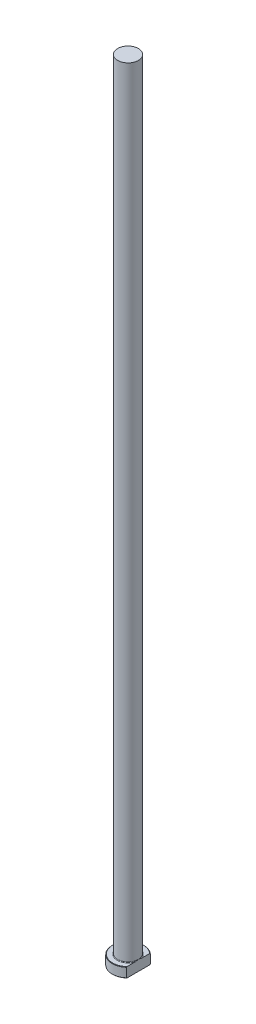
ISO-10303-21;
HEADER;
FILE_DESCRIPTION(('STEP AP214'),'2;1');
FILE_NAME('part.step','',(''),(''),'','','');
FILE_SCHEMA(('AUTOMOTIVE_DESIGN { 1 0 10303 214 1 1 1 1 }'));
ENDSEC;
DATA;
#1=APPLICATION_CONTEXT('core data for automotive mechanical design processes');
#2=APPLICATION_PROTOCOL_DEFINITION('international standard','automotive_design',2000,#1);
#3=PRODUCT_CONTEXT('',#1,'mechanical');
#4=PRODUCT('Part','Part','',(#3));
#5=PRODUCT_RELATED_PRODUCT_CATEGORY('part','',(#4));
#6=PRODUCT_DEFINITION_FORMATION('','',#4);
#7=PRODUCT_DEFINITION_CONTEXT('part definition',#1,'design');
#8=PRODUCT_DEFINITION('design','',#6,#7);
#9=PRODUCT_DEFINITION_SHAPE('','',#8);
#10=(LENGTH_UNIT() NAMED_UNIT(*) SI_UNIT(.MILLI.,.METRE.));
#11=(NAMED_UNIT(*) PLANE_ANGLE_UNIT() SI_UNIT($,.RADIAN.));
#12=(NAMED_UNIT(*) SI_UNIT($,.STERADIAN.) SOLID_ANGLE_UNIT());
#13=UNCERTAINTY_MEASURE_WITH_UNIT(LENGTH_MEASURE(1.E-05),#10,'distance_accuracy_value','');
#14=(GEOMETRIC_REPRESENTATION_CONTEXT(3) GLOBAL_UNCERTAINTY_ASSIGNED_CONTEXT((#13)) GLOBAL_UNIT_ASSIGNED_CONTEXT((#10,
#11,#12)) REPRESENTATION_CONTEXT('',''));
#15=CARTESIAN_POINT('',(0.,0.,0.));
#16=DIRECTION('',(0.,0.,1.));
#17=DIRECTION('',(1.,0.,0.));
#18=AXIS2_PLACEMENT_3D('',#15,#16,#17);
#19=CARTESIAN_POINT('',(0.,0.,0.));
#20=DIRECTION('',(0.,-1.,0.));
#21=DIRECTION('',(0.,0.,-1.));
#22=AXIS2_PLACEMENT_3D('',#19,#20,#21);
#23=PLANE('',#22);
#24=CARTESIAN_POINT('',(0.,0.,0.));
#25=DIRECTION('',(0.,-1.,0.));
#26=DIRECTION('',(0.,0.,-1.));
#27=AXIS2_PLACEMENT_3D('',#24,#25,#26);
#28=CIRCLE('',#27,7.79999999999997);
#29=CARTESIAN_POINT('',(5.24999999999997,0.,5.76866535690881));
#30=VERTEX_POINT('',#29);
#31=CARTESIAN_POINT('',(5.24999999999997,0.,-5.76866535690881));
#32=VERTEX_POINT('',#31);
#33=EDGE_CURVE('E98',#30,#32,#28,.T.);
#34=ORIENTED_EDGE('',*,*,#33,.T.);
#35=DIRECTION('',(0.,0.,1.));
#36=VECTOR('',#35,1.);
#37=CARTESIAN_POINT('',(5.24999999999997,0.,-6.0363482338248));
#38=LINE('',#37,#36);
#39=EDGE_CURVE('E83',#32,#30,#38,.T.);
#40=ORIENTED_EDGE('',*,*,#39,.T.);
#41=EDGE_LOOP('',(#34,#40));
#42=FACE_BOUND('',#41,.T.);
#43=ADVANCED_FACE('F32',(#42),#23,.T.);
#44=CARTESIAN_POINT('',(0.,259.958771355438,0.));
#45=DIRECTION('',(0.,1.,0.));
#46=DIRECTION('',(0.,0.,1.));
#47=AXIS2_PLACEMENT_3D('',#44,#45,#46);
#48=CYLINDRICAL_SURFACE('',#47,7.99999999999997);
#49=CARTESIAN_POINT('',(0.,4.79999999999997,0.));
#50=DIRECTION('',(0.,1.,0.));
#51=DIRECTION('',(0.,0.,1.));
#52=AXIS2_PLACEMENT_3D('',#49,#50,#51);
#53=CIRCLE('',#52,7.99999999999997);
#54=CARTESIAN_POINT('',(5.24999999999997,4.79999999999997,6.0363482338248));
#55=VERTEX_POINT('',#54);
#56=CARTESIAN_POINT('',(5.24999999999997,4.79999999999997,-6.0363482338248));
#57=VERTEX_POINT('',#56);
#58=EDGE_CURVE('E104',#55,#57,#53,.F.);
#59=ORIENTED_EDGE('',*,*,#58,.T.);
#60=DIRECTION('',(0.,-1.,0.));
#61=VECTOR('',#60,1.);
#62=CARTESIAN_POINT('',(5.24999999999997,400.,-6.0363482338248));
#63=LINE('',#62,#61);
#64=CARTESIAN_POINT('',(5.24999999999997,0.199999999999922,-6.0363482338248));
#65=VERTEX_POINT('',#64);
#66=EDGE_CURVE('E183',#57,#65,#63,.T.);
#67=ORIENTED_EDGE('',*,*,#66,.T.);
#68=CARTESIAN_POINT('',(0.,0.199999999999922,0.));
#69=DIRECTION('',(0.,-1.,0.));
#70=DIRECTION('',(0.,0.,-1.));
#71=AXIS2_PLACEMENT_3D('',#68,#69,#70);
#72=CIRCLE('',#71,7.99999999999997);
#73=CARTESIAN_POINT('',(5.24999999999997,0.199999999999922,6.0363482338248));
#74=VERTEX_POINT('',#73);
#75=EDGE_CURVE('E100',#65,#74,#72,.F.);
#76=ORIENTED_EDGE('',*,*,#75,.T.);
#77=DIRECTION('',(0.,-1.,0.));
#78=VECTOR('',#77,1.);
#79=CARTESIAN_POINT('',(5.24999999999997,400.,6.0363482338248));
#80=LINE('',#79,#78);
#81=EDGE_CURVE('E93',#55,#74,#80,.T.);
#82=ORIENTED_EDGE('',*,*,#81,.F.);
#83=EDGE_LOOP('',(#59,#67,#76,#82));
#84=FACE_BOUND('',#83,.T.);
#85=ADVANCED_FACE('F158',(#84),#48,.T.);
#86=CARTESIAN_POINT('',(-7.99999999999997,5.,0.));
#87=DIRECTION('',(0.,1.,0.));
#88=DIRECTION('',(0.,0.,1.));
#89=AXIS2_PLACEMENT_3D('',#86,#87,#88);
#90=PLANE('',#89);
#91=CARTESIAN_POINT('',(0.,5.,0.));
#92=DIRECTION('',(0.,1.,0.));
#93=DIRECTION('',(0.,0.,1.));
#94=AXIS2_PLACEMENT_3D('',#91,#92,#93);
#95=CIRCLE('',#94,7.79999999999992);
#96=CARTESIAN_POINT('',(5.24999999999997,5.,-5.76866535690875));
#97=VERTEX_POINT('',#96);
#98=CARTESIAN_POINT('',(5.24999999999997,5.,5.76866535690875));
#99=VERTEX_POINT('',#98);
#100=EDGE_CURVE('E178',#97,#99,#95,.T.);
#101=ORIENTED_EDGE('',*,*,#100,.T.);
#102=DIRECTION('',(0.,0.,-1.));
#103=VECTOR('',#102,1.);
#104=CARTESIAN_POINT('',(5.24999999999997,5.,0.));
#105=LINE('',#104,#103);
#106=CARTESIAN_POINT('',(5.24999999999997,4.99999999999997,1.79999999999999));
#107=VERTEX_POINT('',#106);
#108=EDGE_CURVE('E57',#99,#107,#105,.T.);
#109=ORIENTED_EDGE('',*,*,#108,.T.);
#110=CARTESIAN_POINT('',(0.,5.,0.));
#111=DIRECTION('',(0.,1.,0.));
#112=DIRECTION('',(0.,0.,1.));
#113=AXIS2_PLACEMENT_3D('',#110,#111,#112);
#114=CIRCLE('',#113,5.54999999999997);
#115=CARTESIAN_POINT('',(5.24999999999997,4.99999999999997,-1.79999999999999));
#116=VERTEX_POINT('',#115);
#117=EDGE_CURVE('E107',#107,#116,#114,.F.);
#118=ORIENTED_EDGE('',*,*,#117,.T.);
#119=EDGE_CURVE('E136',#116,#97,#105,.T.);
#120=ORIENTED_EDGE('',*,*,#119,.T.);
#121=EDGE_LOOP('',(#101,#109,#118,#120));
#122=FACE_BOUND('',#121,.T.);
#123=ADVANCED_FACE('F147',(#122),#90,.T.);
#124=CARTESIAN_POINT('',(0.,5.,0.));
#125=DIRECTION('',(0.,-1.,0.));
#126=DIRECTION('',(0.,0.,-1.));
#127=AXIS2_PLACEMENT_3D('',#124,#125,#126);
#128=CONICAL_SURFACE('',#127,7.79999999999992,0.785398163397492);
#129=ORIENTED_EDGE('',*,*,#58,.F.);
#130=CARTESIAN_POINT('',(5.24999999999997,-1.4811663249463,13.2811600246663));
#131=CARTESIAN_POINT('',(5.24999999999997,-1.29357250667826,13.0794377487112));
#132=CARTESIAN_POINT('',(5.24999999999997,-1.10628451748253,12.8774311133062));
#133=CARTESIAN_POINT('',(5.24999999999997,-0.732415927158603,12.4727618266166));
#134=CARTESIAN_POINT('',(5.24999999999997,-0.545835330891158,12.2700991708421));
#135=CARTESIAN_POINT('',(5.24999999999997,0.0127787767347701,11.6609122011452));
#136=CARTESIAN_POINT('',(5.24999999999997,0.383603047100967,11.2532764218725));
#137=CARTESIAN_POINT('',(5.24999999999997,1.12325341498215,10.4315008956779));
#138=CARTESIAN_POINT('',(5.24999999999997,1.4920519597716,10.017336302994));
#139=CARTESIAN_POINT('',(5.24999999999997,2.22349880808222,9.18368237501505));
#140=CARTESIAN_POINT('',(5.24999999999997,2.58614786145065,8.7641936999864));
#141=CARTESIAN_POINT('',(5.24999999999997,3.23008746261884,8.00331710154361));
#142=CARTESIAN_POINT('',(5.24999999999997,3.51299211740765,7.66330157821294));
#143=CARTESIAN_POINT('',(5.24999999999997,3.93141579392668,7.1483720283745));
#144=CARTESIAN_POINT('',(5.24999999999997,4.06992138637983,6.97588542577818));
#145=CARTESIAN_POINT('',(5.24999999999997,4.34452705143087,6.62901010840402));
#146=CARTESIAN_POINT('',(5.24999999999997,4.48062717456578,6.454621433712));
#147=CARTESIAN_POINT('',(5.24999999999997,4.74973822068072,6.10383934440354));
#148=CARTESIAN_POINT('',(5.24999999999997,4.88275300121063,5.92744889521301));
#149=CARTESIAN_POINT('',(5.24999999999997,5.14521399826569,5.57203856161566));
#150=CARTESIAN_POINT('',(5.24999999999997,5.27466038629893,5.39301880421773));
#151=CARTESIAN_POINT('',(5.24999999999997,5.52907482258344,5.03192492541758));
#152=CARTESIAN_POINT('',(5.24999999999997,5.65404469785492,4.84985209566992));
#153=CARTESIAN_POINT('',(5.24999999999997,5.89840426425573,4.48201214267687));
#154=CARTESIAN_POINT('',(5.24999999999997,6.01779462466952,4.29624546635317));
#155=CARTESIAN_POINT('',(5.24999999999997,6.24171029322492,3.93290441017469));
#156=CARTESIAN_POINT('',(5.24999999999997,6.34669562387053,3.75561494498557));
#157=CARTESIAN_POINT('',(5.24999999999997,6.54883017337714,3.39656407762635));
#158=CARTESIAN_POINT('',(5.24999999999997,6.64597853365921,3.21480218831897));
#159=CARTESIAN_POINT('',(5.24999999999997,6.83020392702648,2.84629933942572));
#160=CARTESIAN_POINT('',(5.24999999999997,6.91728535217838,2.65956059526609));
#161=CARTESIAN_POINT('',(5.24999999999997,7.07861709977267,2.28058919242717));
#162=CARTESIAN_POINT('',(5.24999999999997,7.15287080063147,2.08835799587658));
#163=CARTESIAN_POINT('',(5.24999999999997,7.27107095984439,1.73993363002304));
#164=CARTESIAN_POINT('',(5.24999999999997,7.31810380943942,1.58479376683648));
#165=CARTESIAN_POINT('',(5.24999999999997,7.40035184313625,1.27142880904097));
#166=CARTESIAN_POINT('',(5.24999999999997,7.43557139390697,1.1132048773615));
#167=CARTESIAN_POINT('',(5.24999999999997,7.49247262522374,0.79484251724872));
#168=CARTESIAN_POINT('',(5.24999999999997,7.51419839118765,0.634712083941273));
#169=CARTESIAN_POINT('',(5.24999999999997,7.54310705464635,0.313132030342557));
#170=CARTESIAN_POINT('',(5.24999999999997,7.5502908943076,0.151682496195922));
#171=CARTESIAN_POINT('',(5.24999999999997,7.5496899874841,-0.171726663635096));
#172=CARTESIAN_POINT('',(5.24999999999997,7.54185529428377,-0.333686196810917));
#173=CARTESIAN_POINT('',(5.24999999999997,7.51158499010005,-0.656223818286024));
#174=CARTESIAN_POINT('',(5.24999999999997,7.48914825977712,-0.816801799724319));
#175=CARTESIAN_POINT('',(5.24999999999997,7.43080718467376,-1.13597880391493));
#176=CARTESIAN_POINT('',(5.24999999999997,7.39486058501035,-1.29456998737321));
#177=CARTESIAN_POINT('',(5.24999999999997,7.3111836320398,-1.60857875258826));
#178=CARTESIAN_POINT('',(5.24999999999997,7.26345259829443,-1.76399615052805));
#179=CARTESIAN_POINT('',(5.24999999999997,7.15315151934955,-2.08548717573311));
#180=CARTESIAN_POINT('',(5.24999999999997,7.08962117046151,-2.25122835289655));
#181=CARTESIAN_POINT('',(5.24999999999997,6.95279918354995,-2.57864196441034));
#182=CARTESIAN_POINT('',(5.24999999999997,6.87950469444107,-2.74031319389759));
#183=CARTESIAN_POINT('',(5.24999999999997,6.7248908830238,-3.06007692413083));
#184=CARTESIAN_POINT('',(5.24999999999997,6.64355831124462,-3.21816296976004));
#185=CARTESIAN_POINT('',(5.24999999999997,6.47449809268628,-3.53083072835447));
#186=CARTESIAN_POINT('',(5.24999999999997,6.38677122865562,-3.68541286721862));
#187=CARTESIAN_POINT('',(5.24999999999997,6.20495786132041,-3.99346169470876));
#188=CARTESIAN_POINT('',(5.24999999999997,6.11080410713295,-4.14688850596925));
#189=CARTESIAN_POINT('',(5.24999999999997,5.91814750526,-4.45098066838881));
#190=CARTESIAN_POINT('',(5.24999999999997,5.81964456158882,-4.60164595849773));
#191=CARTESIAN_POINT('',(5.24999999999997,5.61916095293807,-4.90042904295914));
#192=CARTESIAN_POINT('',(5.24999999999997,5.51718369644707,-5.04854913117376));
#193=CARTESIAN_POINT('',(5.24999999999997,5.31027155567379,-5.3427009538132));
#194=CARTESIAN_POINT('',(5.24999999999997,5.20533670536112,-5.48873271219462));
#195=CARTESIAN_POINT('',(5.24999999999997,4.9710698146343,-5.80895105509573));
#196=CARTESIAN_POINT('',(5.24999999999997,4.84117419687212,-5.9827248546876));
#197=CARTESIAN_POINT('',(5.24999999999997,4.57844088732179,-6.32803694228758));
#198=CARTESIAN_POINT('',(5.24999999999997,4.44560309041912,-6.49957515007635));
#199=CARTESIAN_POINT('',(5.24999999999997,4.04344241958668,-7.01138747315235));
#200=CARTESIAN_POINT('',(5.24999999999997,3.77050218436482,-7.34881891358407));
#201=CARTESIAN_POINT('',(5.24999999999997,3.21761339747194,-8.01842681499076));
#202=CARTESIAN_POINT('',(5.24999999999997,2.93765803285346,-8.35059761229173));
#203=CARTESIAN_POINT('',(5.24999999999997,2.37280482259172,-9.01071908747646));
#204=CARTESIAN_POINT('',(5.24999999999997,2.0879068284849,-9.33866963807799));
#205=CARTESIAN_POINT('',(5.24999999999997,1.53221513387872,-9.97104652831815));
#206=CARTESIAN_POINT('',(5.24999999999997,1.26164416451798,-10.2756690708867));
#207=CARTESIAN_POINT('',(5.24999999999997,0.717945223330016,-10.8826342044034));
#208=CARTESIAN_POINT('',(5.24999999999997,0.444817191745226,-11.184976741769));
#209=CARTESIAN_POINT('',(5.24999999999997,-0.102863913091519,-11.7871569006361));
#210=CARTESIAN_POINT('',(5.24999999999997,-0.3774125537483,-12.0869985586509));
#211=CARTESIAN_POINT('',(5.24999999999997,-0.92814850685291,-12.6851474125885));
#212=CARTESIAN_POINT('',(5.24999999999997,-1.20433574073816,-12.9834546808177));
#213=CARTESIAN_POINT('',(5.24999999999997,-1.4811663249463,-13.2811600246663));
#214=B_SPLINE_CURVE_WITH_KNOTS('',3,(#130,#131,#132,#133,#134,#135,#136,#137,#138,#139,#140,
#141,#142,#143,#144,#145,#146,#147,#148,#149,#150,#151,#152,#153,#154,#155,#156,#157,#158,#159,
#160,#161,#162,#163,#164,#165,#166,#167,#168,#169,#170,#171,#172,#173,#174,#175,#176,#177,#178,
#179,#180,#181,#182,#183,#184,#185,#186,#187,#188,#189,#190,#191,#192,#193,#194,#195,#196,#197,
#198,#199,#200,#201,#202,#203,#204,#205,#206,#207,#208,#209,#210,#211,#212,#213),.UNSPECIFIED.,
.F.,.F.,(4,2,2,2,2,2,2,2,2,2,2,2,2,2,2,2,2,2,2,2,2,2,2,2,2,2,2,2,2,2,2,2,2,2,2,2,2,2,2,2,2,4),
(0.,0.826407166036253,1.65282000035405,3.30600459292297,4.9696651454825,6.63312135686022,
7.9599789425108,8.62360280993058,9.28721271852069,9.94994254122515,10.6126404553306,
11.2750647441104,11.9374093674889,12.555381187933,13.1734206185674,13.7911893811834,
14.4087951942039,14.8947423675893,15.3805097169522,15.8646815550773,16.3488220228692,
16.8345753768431,17.3203659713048,17.8076887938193,18.2950397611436,18.8271554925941,
19.3594269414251,19.8925908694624,20.4256896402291,20.9656407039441,21.5056036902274,
22.0450513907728,22.5844928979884,23.2353229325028,23.8861762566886,25.1880335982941,
26.4912084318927,27.7944224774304,29.0167115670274,30.2390292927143,31.4586693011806,
32.6782512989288),.UNSPECIFIED.);
#215=EDGE_CURVE('E135',#55,#99,#214,.T.);
#216=ORIENTED_EDGE('',*,*,#215,.T.);
#217=ORIENTED_EDGE('',*,*,#100,.F.);
#218=EDGE_CURVE('E127',#97,#57,#214,.T.);
#219=ORIENTED_EDGE('',*,*,#218,.T.);
#220=EDGE_LOOP('',(#129,#216,#217,#219));
#221=FACE_BOUND('',#220,.T.);
#222=ADVANCED_FACE('F143',(#221),#128,.T.);
#223=CARTESIAN_POINT('',(0.,0.199999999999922,0.));
#224=DIRECTION('',(0.,1.,0.));
#225=DIRECTION('',(0.,0.,1.));
#226=AXIS2_PLACEMENT_3D('',#223,#224,#225);
#227=CONICAL_SURFACE('',#226,7.99999999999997,0.78539816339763);
#228=ORIENTED_EDGE('',*,*,#75,.F.);
#229=CARTESIAN_POINT('',(5.24999999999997,6.48116632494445,-13.2811600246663));
#230=CARTESIAN_POINT('',(5.24999999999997,6.29357250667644,-13.0794377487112));
#231=CARTESIAN_POINT('',(5.24999999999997,6.10628451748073,-12.8774311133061));
#232=CARTESIAN_POINT('',(5.24999999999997,5.73241592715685,-12.4727618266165));
#233=CARTESIAN_POINT('',(5.24999999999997,5.54583533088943,-12.2700991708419));
#234=CARTESIAN_POINT('',(5.24999999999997,4.98722122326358,-11.6609122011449));
#235=CARTESIAN_POINT('',(5.24999999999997,4.61639695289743,-11.2532764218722));
#236=CARTESIAN_POINT('',(5.24999999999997,3.87674658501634,-10.4315008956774));
#237=CARTESIAN_POINT('',(5.24999999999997,3.50794804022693,-10.0173363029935));
#238=CARTESIAN_POINT('',(5.24999999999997,2.77650119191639,-9.18368237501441));
#239=CARTESIAN_POINT('',(5.24999999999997,2.41385213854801,-8.76419369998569));
#240=CARTESIAN_POINT('',(5.24999999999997,1.76991253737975,-8.00331710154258));
#241=CARTESIAN_POINT('',(5.24999999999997,1.48700788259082,-7.66330157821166));
#242=CARTESIAN_POINT('',(5.24999999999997,1.06858420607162,-7.14837202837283));
#243=CARTESIAN_POINT('',(5.24999999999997,0.930078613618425,-6.97588542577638));
#244=CARTESIAN_POINT('',(5.24999999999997,0.655472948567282,-6.62901010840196));
#245=CARTESIAN_POINT('',(5.24999999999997,0.519372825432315,-6.4546214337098));
#246=CARTESIAN_POINT('',(5.24999999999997,0.250261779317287,-6.10383934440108));
#247=CARTESIAN_POINT('',(5.24999999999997,0.117246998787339,-5.92744889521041));
#248=CARTESIAN_POINT('',(5.24999999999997,-0.145213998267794,-5.57203856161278));
#249=CARTESIAN_POINT('',(5.24999999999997,-0.274660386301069,-5.39301880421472));
#250=CARTESIAN_POINT('',(5.24999999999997,-0.529074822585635,-5.03192492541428));
#251=CARTESIAN_POINT('',(5.24999999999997,-0.654044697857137,-4.84985209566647));
#252=CARTESIAN_POINT('',(5.24999999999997,-0.898404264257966,-4.48201214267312));
#253=CARTESIAN_POINT('',(5.24999999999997,-1.01779462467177,-4.29624546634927));
#254=CARTESIAN_POINT('',(5.24999999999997,-1.24171029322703,-3.93290441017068));
#255=CARTESIAN_POINT('',(5.24999999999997,-1.34669562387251,-3.75561494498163));
#256=CARTESIAN_POINT('',(5.24999999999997,-1.54883017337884,-3.39656407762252));
#257=CARTESIAN_POINT('',(5.24999999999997,-1.64597853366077,-3.21480218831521));
#258=CARTESIAN_POINT('',(5.24999999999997,-1.83020392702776,-2.84629933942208));
#259=CARTESIAN_POINT('',(5.24999999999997,-1.91728535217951,-2.65956059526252));
#260=CARTESIAN_POINT('',(5.24999999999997,-2.07861709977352,-2.28058919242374));
#261=CARTESIAN_POINT('',(5.24999999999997,-2.15287080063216,-2.08835799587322));
#262=CARTESIAN_POINT('',(5.24999999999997,-2.27107095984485,-1.73993363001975));
#263=CARTESIAN_POINT('',(5.24999999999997,-2.31810380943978,-1.58479376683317));
#264=CARTESIAN_POINT('',(5.24999999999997,-2.40035184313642,-1.27142880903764));
#265=CARTESIAN_POINT('',(5.24999999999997,-2.43557139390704,-1.11320487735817));
#266=CARTESIAN_POINT('',(5.24999999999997,-2.4924726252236,-0.794842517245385));
#267=CARTESIAN_POINT('',(5.24999999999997,-2.5141983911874,-0.63471208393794));
#268=CARTESIAN_POINT('',(5.24999999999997,-2.54310705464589,-0.313132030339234));
#269=CARTESIAN_POINT('',(5.24999999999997,-2.55029089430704,-0.15168249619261));
#270=CARTESIAN_POINT('',(5.24999999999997,-2.54968998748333,0.17172666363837));
#271=CARTESIAN_POINT('',(5.24999999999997,-2.5418552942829,0.333686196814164));
#272=CARTESIAN_POINT('',(5.24999999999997,-2.511584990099,0.656223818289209));
#273=CARTESIAN_POINT('',(5.24999999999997,-2.489148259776,0.816801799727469));
#274=CARTESIAN_POINT('',(5.24999999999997,-2.43080718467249,1.135978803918));
#275=CARTESIAN_POINT('',(5.24999999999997,-2.39486058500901,1.29456998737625));
#276=CARTESIAN_POINT('',(5.24999999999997,-2.31118363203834,1.60857875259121));
#277=CARTESIAN_POINT('',(5.24999999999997,-2.26345259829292,1.76399615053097));
#278=CARTESIAN_POINT('',(5.24999999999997,-2.15315151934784,2.08548717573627));
#279=CARTESIAN_POINT('',(5.24999999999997,-2.08962117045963,2.2512283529));
#280=CARTESIAN_POINT('',(5.24999999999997,-1.9527991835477,2.57864196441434));
#281=CARTESIAN_POINT('',(5.24999999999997,-1.87950469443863,2.74031319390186));
#282=CARTESIAN_POINT('',(5.24999999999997,-1.72489088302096,3.06007692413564));
#283=CARTESIAN_POINT('',(5.24999999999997,-1.64355831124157,3.21816296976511));
#284=CARTESIAN_POINT('',(5.24999999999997,-1.4744980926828,3.53083072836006));
#285=CARTESIAN_POINT('',(5.24999999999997,-1.38677122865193,3.68541286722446));
#286=CARTESIAN_POINT('',(5.24999999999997,-1.20495786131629,3.99346169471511));
#287=CARTESIAN_POINT('',(5.24999999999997,-1.1108041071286,4.14688850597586));
#288=CARTESIAN_POINT('',(5.24999999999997,-0.9181475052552,4.45098066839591));
#289=CARTESIAN_POINT('',(5.24999999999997,-0.8196445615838,4.60164595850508));
#290=CARTESIAN_POINT('',(5.24999999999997,-0.619160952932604,4.90042904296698));
#291=CARTESIAN_POINT('',(5.24999999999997,-0.51718369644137,5.04854913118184));
#292=CARTESIAN_POINT('',(5.24999999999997,-0.310271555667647,5.34270095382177));
#293=CARTESIAN_POINT('',(5.24999999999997,-0.205336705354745,5.48873271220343));
#294=CARTESIAN_POINT('',(5.24999999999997,0.0289301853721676,5.80895105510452));
#295=CARTESIAN_POINT('',(5.24999999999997,0.1588258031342,5.98272485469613));
#296=CARTESIAN_POINT('',(5.24999999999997,0.421559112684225,6.32803694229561));
#297=CARTESIAN_POINT('',(5.24999999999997,0.554396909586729,6.49957515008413));
#298=CARTESIAN_POINT('',(5.24999999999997,0.956557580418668,7.01138747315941));
#299=CARTESIAN_POINT('',(5.24999999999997,1.22949781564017,7.34881891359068));
#300=CARTESIAN_POINT('',(5.24999999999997,1.78238660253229,8.01842681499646));
#301=CARTESIAN_POINT('',(5.24999999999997,2.06234196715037,8.350597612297));
#302=CARTESIAN_POINT('',(5.24999999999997,2.62719517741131,9.01071908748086));
#303=CARTESIAN_POINT('',(5.24999999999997,2.91209317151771,9.33866963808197));
#304=CARTESIAN_POINT('',(5.24999999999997,3.46778486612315,9.97104652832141));
#305=CARTESIAN_POINT('',(5.24999999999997,3.73835583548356,10.2756690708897));
#306=CARTESIAN_POINT('',(5.24999999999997,4.28205477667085,10.8826342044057));
#307=CARTESIAN_POINT('',(5.24999999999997,4.5551828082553,11.184976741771));
#308=CARTESIAN_POINT('',(5.24999999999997,5.10286391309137,11.7871569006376));
#309=CARTESIAN_POINT('',(5.24999999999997,5.37741255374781,12.0869985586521));
#310=CARTESIAN_POINT('',(5.24999999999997,5.92814850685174,12.685147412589));
#311=CARTESIAN_POINT('',(5.24999999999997,6.20433574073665,12.9834546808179));
#312=CARTESIAN_POINT('',(5.24999999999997,6.48116632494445,13.2811600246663));
#313=B_SPLINE_CURVE_WITH_KNOTS('',3,(#229,#230,#231,#232,#233,#234,#235,#236,#237,#238,#239,
#240,#241,#242,#243,#244,#245,#246,#247,#248,#249,#250,#251,#252,#253,#254,#255,#256,#257,#258,
#259,#260,#261,#262,#263,#264,#265,#266,#267,#268,#269,#270,#271,#272,#273,#274,#275,#276,#277,
#278,#279,#280,#281,#282,#283,#284,#285,#286,#287,#288,#289,#290,#291,#292,#293,#294,#295,#296,
#297,#298,#299,#300,#301,#302,#303,#304,#305,#306,#307,#308,#309,#310,#311,#312),.UNSPECIFIED.,
.F.,.F.,(4,2,2,2,2,2,2,2,2,2,2,2,2,2,2,2,2,2,2,2,2,2,2,2,2,2,2,2,2,2,2,2,2,2,2,2,2,2,2,2,2,4),
(0.,0.826407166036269,1.65282000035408,3.30600459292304,4.96966514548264,6.63312135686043,
7.95997894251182,8.62360280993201,9.28721271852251,9.94994254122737,10.6126404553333,
11.2750647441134,11.9374093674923,12.5553811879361,13.1734206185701,13.7911893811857,
14.4087951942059,14.8947423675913,15.3805097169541,15.8646815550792,16.348822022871,
16.8345753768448,17.3203659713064,17.8076887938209,18.2950397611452,18.8271554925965,
19.3594269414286,19.8925908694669,20.4256896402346,20.9656407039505,21.5056036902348,
22.0450513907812,22.5844928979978,23.2353229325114,23.8861762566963,25.1880335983,
26.4912084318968,27.7944224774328,29.0167115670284,30.239029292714,31.458669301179,
32.6782512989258),.UNSPECIFIED.);
#314=EDGE_CURVE('E86',#65,#32,#313,.T.);
#315=ORIENTED_EDGE('',*,*,#314,.T.);
#316=ORIENTED_EDGE('',*,*,#33,.F.);
#317=EDGE_CURVE('E89',#30,#74,#313,.T.);
#318=ORIENTED_EDGE('',*,*,#317,.T.);
#319=EDGE_LOOP('',(#228,#315,#316,#318));
#320=FACE_BOUND('',#319,.T.);
#321=ADVANCED_FACE('F97',(#320),#227,.T.);
#322=CARTESIAN_POINT('',(0.,5.29999999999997,0.));
#323=DIRECTION('',(0.,1.,0.));
#324=DIRECTION('',(0.,0.,1.));
#325=AXIS2_PLACEMENT_3D('',#322,#323,#324);
#326=TOROIDAL_SURFACE('',#325,5.54999999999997,0.3);
#327=CARTESIAN_POINT('',(5.24999999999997,5.29999999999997,0.));
#328=CARTESIAN_POINT('',(5.24999999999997,5.30000062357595,1.16656166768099E-10));
#329=CARTESIAN_POINT('',(5.24999999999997,5.30000124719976,-2.61240012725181E-07));
#330=CARTESIAN_POINT('',(5.24999999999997,5.30000240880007,-9.73737247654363E-07));
#331=CARTESIAN_POINT('',(5.24999999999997,5.3000029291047,-1.44300381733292E-06));
#332=CARTESIAN_POINT('',(5.24999999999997,5.30000402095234,-2.56984529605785E-06));
#333=CARTESIAN_POINT('',(5.24999999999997,5.30000457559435,-3.24572224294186E-06));
#334=CARTESIAN_POINT('',(5.24999999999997,5.30000555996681,-4.63899443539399E-06));
#335=CARTESIAN_POINT('',(5.24999999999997,5.30000599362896,-5.35385174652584E-06));
#336=CARTESIAN_POINT('',(5.24999999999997,5.30000762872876,-8.15275638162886E-06));
#337=CARTESIAN_POINT('',(5.24999999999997,5.30000874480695,-1.02903375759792E-05));
#338=CARTESIAN_POINT('',(5.24999999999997,5.30001055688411,-1.44997307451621E-05));
#339=CARTESIAN_POINT('',(5.24999999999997,5.30001128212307,-1.65594410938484E-05));
#340=CARTESIAN_POINT('',(5.24999999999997,5.30001436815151,-2.53621688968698E-05));
#341=CARTESIAN_POINT('',(5.24999999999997,5.30001670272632,-3.21176555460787E-05));
#342=CARTESIAN_POINT('',(5.24999999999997,5.30002009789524,-4.48185660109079E-05));
#343=CARTESIAN_POINT('',(5.24999999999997,5.30002130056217,-5.07256098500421E-05));
#344=CARTESIAN_POINT('',(5.24999999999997,5.300030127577,-9.48741140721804E-05));
#345=CARTESIAN_POINT('',(5.24999999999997,5.30003689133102,-0.000133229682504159));
#346=CARTESIAN_POINT('',(5.24999999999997,5.30006649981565,-0.00028531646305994));
#347=CARTESIAN_POINT('',(5.24999999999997,5.30009467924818,-0.000398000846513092));
#348=CARTESIAN_POINT('',(5.24999999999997,5.30020485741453,-0.000845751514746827));
#349=CARTESIAN_POINT('',(5.24999999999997,5.30028346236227,-0.00118137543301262));
#350=CARTESIAN_POINT('',(5.24999999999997,5.30059922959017,-0.00251998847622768));
#351=CARTESIAN_POINT('',(5.24999999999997,5.30084070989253,-0.0035222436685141));
#352=CARTESIAN_POINT('',(5.24999999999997,5.3018480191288,-0.00771382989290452));
#353=CARTESIAN_POINT('',(5.24999999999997,5.30260840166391,-0.0109040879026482));
#354=CARTESIAN_POINT('',(5.24999999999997,5.30980219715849,-0.0410723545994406));
#355=CARTESIAN_POINT('',(5.24999999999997,5.31625953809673,-0.0680464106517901));
#356=CARTESIAN_POINT('',(5.24999999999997,5.32887570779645,-0.120910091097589));
#357=CARTESIAN_POINT('',(5.24999999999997,5.33503603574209,-0.146799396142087));
#358=CARTESIAN_POINT('',(5.24999999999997,5.34810832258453,-0.201908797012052));
#359=CARTESIAN_POINT('',(5.24999999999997,5.35501531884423,-0.231130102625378));
#360=CARTESIAN_POINT('',(5.24999999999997,5.3688279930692,-0.289915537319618));
#361=CARTESIAN_POINT('',(5.24999999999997,5.37573280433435,-0.31947986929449));
#362=CARTESIAN_POINT('',(5.24999999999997,5.39233240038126,-0.391129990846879));
#363=CARTESIAN_POINT('',(5.24999999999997,5.40197331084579,-0.433228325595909));
#364=CARTESIAN_POINT('',(5.24999999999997,5.42071775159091,-0.516417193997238));
#365=CARTESIAN_POINT('',(5.24999999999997,5.42982871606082,-0.557506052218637));
#366=CARTESIAN_POINT('',(5.24999999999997,5.45024545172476,-0.651521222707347));
#367=CARTESIAN_POINT('',(5.24999999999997,5.46143398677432,-0.70447326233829));
#368=CARTESIAN_POINT('',(5.24999999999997,5.48311687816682,-0.810941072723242));
#369=CARTESIAN_POINT('',(5.24999999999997,5.49360525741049,-0.864458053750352));
#370=CARTESIAN_POINT('',(5.24999999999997,5.5252275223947,-1.03405951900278));
#371=CARTESIAN_POINT('',(5.24999999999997,5.54454970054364,-1.15049679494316));
#372=CARTESIAN_POINT('',(5.24999999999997,5.57371765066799,-1.36731361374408));
#373=CARTESIAN_POINT('',(5.24999999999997,5.58453543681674,-1.4675540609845));
#374=CARTESIAN_POINT('',(5.24999999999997,5.59494335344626,-1.61734655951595));
#375=CARTESIAN_POINT('',(5.24999999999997,5.5974458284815,-1.66669122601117));
#376=CARTESIAN_POINT('',(5.24999999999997,5.60018139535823,-1.76542367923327));
#377=CARTESIAN_POINT('',(5.24999999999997,5.60041538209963,-1.81481144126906));
#378=CARTESIAN_POINT('',(5.24999999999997,5.59770699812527,-1.92992281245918));
#379=CARTESIAN_POINT('',(5.24999999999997,5.59368653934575,-1.99563731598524));
#380=CARTESIAN_POINT('',(5.24999999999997,5.58239535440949,-2.09375112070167));
#381=CARTESIAN_POINT('',(5.24999999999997,5.5777387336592,-2.12645109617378));
#382=CARTESIAN_POINT('',(5.24999999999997,5.56623568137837,-2.19145637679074));
#383=CARTESIAN_POINT('',(5.24999999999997,5.55939081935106,-2.22376194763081));
#384=CARTESIAN_POINT('',(5.24999999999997,5.54289171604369,-2.28774017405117));
#385=CARTESIAN_POINT('',(5.24999999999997,5.53323089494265,-2.31941115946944));
#386=CARTESIAN_POINT('',(5.24999999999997,5.5101870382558,-2.38130147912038));
#387=CARTESIAN_POINT('',(5.24999999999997,5.49682279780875,-2.41152726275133));
#388=CARTESIAN_POINT('',(5.24999999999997,5.47383686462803,-2.45267588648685));
#389=CARTESIAN_POINT('',(5.24999999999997,5.46640062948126,-2.46481176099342));
#390=CARTESIAN_POINT('',(5.24999999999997,5.45028535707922,-2.48829012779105));
#391=CARTESIAN_POINT('',(5.24999999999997,5.44160336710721,-2.49963063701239));
#392=CARTESIAN_POINT('',(5.24999999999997,5.42264067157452,-2.52121093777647));
#393=CARTESIAN_POINT('',(5.24999999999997,5.41233846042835,-2.53143222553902));
#394=CARTESIAN_POINT('',(5.24999999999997,5.39001295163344,-2.54977752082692));
#395=CARTESIAN_POINT('',(5.24999999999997,5.3779990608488,-2.55791235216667));
#396=CARTESIAN_POINT('',(5.24999999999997,5.35800000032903,-2.56805143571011));
#397=CARTESIAN_POINT('',(5.24999999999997,5.3505843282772,-2.57117564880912));
#398=CARTESIAN_POINT('',(5.24999999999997,5.33534289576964,-2.57618429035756));
#399=CARTESIAN_POINT('',(5.24999999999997,5.32751754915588,-2.57806994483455));
#400=CARTESIAN_POINT('',(5.24999999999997,5.311605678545,-2.58043009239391));
#401=CARTESIAN_POINT('',(5.24999999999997,5.3035179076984,-2.58089637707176));
#402=CARTESIAN_POINT('',(5.24999999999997,5.28739280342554,-2.58034271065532));
#403=CARTESIAN_POINT('',(5.24999999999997,5.27935547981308,-2.5793224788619));
#404=CARTESIAN_POINT('',(5.24999999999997,5.2641286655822,-2.576023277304));
#405=CARTESIAN_POINT('',(5.24999999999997,5.25691883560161,-2.57383545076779));
#406=CARTESIAN_POINT('',(5.24999999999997,5.24289768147,-2.56843751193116));
#407=CARTESIAN_POINT('',(5.24999999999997,5.23608651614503,-2.5652269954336));
#408=CARTESIAN_POINT('',(5.24999999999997,5.21908960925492,-2.55585712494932));
#409=CARTESIAN_POINT('',(5.24999999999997,5.20925106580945,-2.54906973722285));
#410=CARTESIAN_POINT('',(5.24999999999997,5.19074002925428,-2.53405361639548));
#411=CARTESIAN_POINT('',(5.24999999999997,5.1820713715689,-2.52582033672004));
#412=CARTESIAN_POINT('',(5.24999999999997,5.15973027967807,-2.50189565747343));
#413=CARTESIAN_POINT('',(5.24999999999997,5.14713154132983,-2.4852116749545));
#414=CARTESIAN_POINT('',(5.24999999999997,5.12441873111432,-2.45028247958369));
#415=CARTESIAN_POINT('',(5.24999999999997,5.11430835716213,-2.43203499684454));
#416=CARTESIAN_POINT('',(5.24999999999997,5.095460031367,-2.39348631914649));
#417=CARTESIAN_POINT('',(5.24999999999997,5.08684143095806,-2.3731276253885));
#418=CARTESIAN_POINT('',(5.24999999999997,5.07130293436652,-2.33176174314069));
#419=CARTESIAN_POINT('',(5.24999999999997,5.0643850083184,-2.31075383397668));
#420=CARTESIAN_POINT('',(5.24999999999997,5.05188132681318,-2.26814065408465));
#421=CARTESIAN_POINT('',(5.24999999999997,5.04630843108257,-2.24653166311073));
#422=CARTESIAN_POINT('',(5.24999999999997,5.036346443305,-2.20306277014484));
#423=CARTESIAN_POINT('',(5.24999999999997,5.03195656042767,-2.18120304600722));
#424=CARTESIAN_POINT('',(5.24999999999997,5.02182394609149,-2.12403914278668));
#425=CARTESIAN_POINT('',(5.24999999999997,5.01686753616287,-2.08859566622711));
#426=CARTESIAN_POINT('',(5.24999999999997,5.00900730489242,-2.01747645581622));
#427=CARTESIAN_POINT('',(5.24999999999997,5.0061045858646,-1.98180060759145));
#428=CARTESIAN_POINT('',(5.24999999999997,4.99990490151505,-1.87441007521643));
#429=CARTESIAN_POINT('',(5.24999999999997,4.99914942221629,-1.80254846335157));
#430=CARTESIAN_POINT('',(5.24999999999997,5.00239161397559,-1.66261916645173));
#431=CARTESIAN_POINT('',(5.24999999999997,5.00615102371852,-1.59454326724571));
#432=CARTESIAN_POINT('',(5.24999999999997,5.0170133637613,-1.45862908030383));
#433=CARTESIAN_POINT('',(5.24999999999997,5.02411815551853,-1.39079094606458));
#434=CARTESIAN_POINT('',(5.24999999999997,5.04416126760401,-1.22927166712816));
#435=CARTESIAN_POINT('',(5.24999999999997,5.05829298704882,-1.1357414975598));
#436=CARTESIAN_POINT('',(5.24999999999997,5.08230499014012,-0.994796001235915));
#437=CARTESIAN_POINT('',(5.24999999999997,5.09089456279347,-0.947150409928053));
#438=CARTESIAN_POINT('',(5.24999999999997,5.10886306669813,-0.851871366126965));
#439=CARTESIAN_POINT('',(5.24999999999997,5.11824411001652,-0.804238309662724));
#440=CARTESIAN_POINT('',(5.24999999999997,5.141356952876,-0.690797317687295));
#441=CARTESIAN_POINT('',(5.24999999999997,5.15537399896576,-0.625047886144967));
#442=CARTESIAN_POINT('',(5.24999999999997,5.18409655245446,-0.494483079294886));
#443=CARTESIAN_POINT('',(5.24999999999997,5.19879244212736,-0.429665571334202));
#444=CARTESIAN_POINT('',(5.24999999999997,5.22697974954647,-0.307614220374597));
#445=CARTESIAN_POINT('',(5.24999999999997,5.24041481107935,-0.250367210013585));
#446=CARTESIAN_POINT('',(5.24999999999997,5.26812039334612,-0.133445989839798));
#447=CARTESIAN_POINT('',(5.24999999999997,5.28240186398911,-0.0737742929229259));
#448=CARTESIAN_POINT('',(5.24999999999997,5.29739294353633,-0.0108979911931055));
#449=CARTESIAN_POINT('',(5.24999999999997,5.2981548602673,-0.00770166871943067));
#450=CARTESIAN_POINT('',(5.24999999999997,5.29916252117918,-0.00350872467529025));
#451=CARTESIAN_POINT('',(5.24999999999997,5.29940286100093,-0.0025111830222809));
#452=CARTESIAN_POINT('',(5.24999999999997,5.299717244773,-0.00117843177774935));
#453=CARTESIAN_POINT('',(5.24999999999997,5.2997955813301,-0.000843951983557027));
#454=CARTESIAN_POINT('',(5.24999999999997,5.29990543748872,-0.000397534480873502));
#455=CARTESIAN_POINT('',(5.24999999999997,5.29993357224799,-0.000285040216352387));
#456=CARTESIAN_POINT('',(5.24999999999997,5.29996313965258,-0.000133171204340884));
#457=CARTESIAN_POINT('',(5.24999999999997,5.29996989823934,-9.48416473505E-05));
#458=CARTESIAN_POINT('',(5.24999999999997,5.29997871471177,-5.07197787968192E-05));
#459=CARTESIAN_POINT('',(5.24999999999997,5.29997991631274,-4.48141195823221E-05));
#460=CARTESIAN_POINT('',(5.24999999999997,5.29998330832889,-3.21161025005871E-05));
#461=CARTESIAN_POINT('',(5.24999999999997,5.29998564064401,-2.53620513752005E-05));
#462=CARTESIAN_POINT('',(5.24999999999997,5.29998872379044,-1.65608283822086E-05));
#463=CARTESIAN_POINT('',(5.24999999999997,5.29998944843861,-1.4501220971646E-05));
#464=CARTESIAN_POINT('',(5.24999999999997,5.29999125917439,-1.02919418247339E-05));
#465=CARTESIAN_POINT('',(5.24999999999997,5.29999237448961,-8.15435788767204E-06));
#466=CARTESIAN_POINT('',(5.24999999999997,5.29999400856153,-5.35534366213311E-06));
#467=CARTESIAN_POINT('',(5.24999999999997,5.29999444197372,-4.6404252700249E-06));
#468=CARTESIAN_POINT('',(5.24999999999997,5.2999954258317,-3.24698579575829E-06));
#469=CARTESIAN_POINT('',(5.24999999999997,5.29999598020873,-2.57100068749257E-06));
#470=CARTESIAN_POINT('',(5.24999999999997,5.29999707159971,-1.44390781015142E-06));
#471=CARTESIAN_POINT('',(5.24999999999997,5.29999759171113,-9.74508164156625E-07));
#472=CARTESIAN_POINT('',(5.24999999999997,5.29999875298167,-2.61670627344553E-07));
#473=CARTESIAN_POINT('',(5.24999999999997,5.29999937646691,-1.166481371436E-10));
#474=CARTESIAN_POINT('',(5.24999999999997,5.29999999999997,0.));
#475=B_SPLINE_CURVE_WITH_KNOTS('',3,(#327,#328,#329,#330,#331,#332,#333,#334,#335,#336,#337,
#338,#339,#340,#341,#342,#343,#344,#345,#346,#347,#348,#349,#350,#351,#352,#353,#354,#355,#356,
#357,#358,#359,#360,#361,#362,#363,#364,#365,#366,#367,#368,#369,#370,#371,#372,#373,#374,#375,
#376,#377,#378,#379,#380,#381,#382,#383,#384,#385,#386,#387,#388,#389,#390,#391,#392,#393,#394,
#395,#396,#397,#398,#399,#400,#401,#402,#403,#404,#405,#406,#407,#408,#409,#410,#411,#412,#413,
#414,#415,#416,#417,#418,#419,#420,#421,#422,#423,#424,#425,#426,#427,#428,#429,#430,#431,#432,
#433,#434,#435,#436,#437,#438,#439,#440,#441,#442,#443,#444,#445,#446,#447,#448,#449,#450,#451,
#452,#453,#454,#455,#456,#457,#458,#459,#460,#461,#462,#463,#464,#465,#466,#467,#468,#469,#470,
#471,#472,#473,#474),.UNSPECIFIED.,.T.,.F.,(4,2,2,2,2,2,2,2,2,2,2,2,2,2,2,2,2,2,2,2,2,2,2,2,2,2,
2,2,2,2,2,2,2,2,2,2,2,2,2,2,2,2,2,2,2,2,2,2,2,2,2,2,2,2,2,2,2,2,2,2,2,2,2,2,2,2,2,2,2,2,2,2,2,
4),(0.,1.89392886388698E-06,4.00212801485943E-06,6.60801824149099E-06,9.1153264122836E-06,
1.63248449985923E-05,2.28697708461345E-05,4.42789050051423E-05,6.23424765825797E-05,
0.000179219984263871,0.00052739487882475,0.00156181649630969,0.00465425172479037,
0.0144935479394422,0.0976999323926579,0.177536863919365,0.267616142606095,0.358695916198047,
0.488259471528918,0.61451916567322,0.776877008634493,0.940479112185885,1.29442390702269,
1.59666224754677,1.74484158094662,1.89296245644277,2.09015926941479,2.18919604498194,
2.28816194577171,2.38736097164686,2.48606549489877,2.528709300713,2.57145590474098,
2.61482708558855,2.65796850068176,2.68202106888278,2.70604979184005,2.73021721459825,
2.75438920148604,2.77690311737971,2.79942594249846,2.8350772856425,2.87084280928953,
2.93320923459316,2.99566778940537,3.06188854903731,3.12818566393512,3.19509354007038,
3.26195657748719,3.36923775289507,3.47657646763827,3.69190663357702,3.8963555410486,
4.10091834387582,4.38458684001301,4.52982429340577,4.6754623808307,4.87713507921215,
5.0765191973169,5.25292680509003,5.43699224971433,5.44685029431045,5.44992818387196,
5.45095907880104,5.45130666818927,5.4514234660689,5.45144152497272,5.45146292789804,
5.45146947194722,5.45147668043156,5.45147918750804,5.45148179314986,5.45148390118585,
5.45148579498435),.UNSPECIFIED.);
#476=CARTESIAN_POINT('',(5.24999999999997,5.29999999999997,0.));
#477=VERTEX_POINT('',#476);
#478=EDGE_CURVE('E11',#116,#477,#475,.T.);
#479=ORIENTED_EDGE('',*,*,#478,.F.);
#480=ORIENTED_EDGE('',*,*,#117,.F.);
#481=CARTESIAN_POINT('',(5.24999999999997,5.29999999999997,0.));
#482=CARTESIAN_POINT('',(5.24999999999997,5.29999937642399,-1.16656200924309E-10));
#483=CARTESIAN_POINT('',(5.24999999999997,5.29999875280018,2.61240012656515E-07));
#484=CARTESIAN_POINT('',(5.24999999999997,5.29999759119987,9.73737247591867E-07));
#485=CARTESIAN_POINT('',(5.24999999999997,5.29999707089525,1.44300381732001E-06));
#486=CARTESIAN_POINT('',(5.24999999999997,5.2999959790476,2.56984529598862E-06));
#487=CARTESIAN_POINT('',(5.24999999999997,5.29999542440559,3.2457222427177E-06));
#488=CARTESIAN_POINT('',(5.24999999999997,5.29999444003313,4.63899443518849E-06));
#489=CARTESIAN_POINT('',(5.24999999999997,5.29999400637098,5.35385174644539E-06));
#490=CARTESIAN_POINT('',(5.24999999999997,5.29999237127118,8.15275638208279E-06));
#491=CARTESIAN_POINT('',(5.24999999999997,5.29999125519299,1.02903375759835E-05));
#492=CARTESIAN_POINT('',(5.24999999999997,5.29998944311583,1.44997307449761E-05));
#493=CARTESIAN_POINT('',(5.24999999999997,5.29998871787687,1.65594410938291E-05));
#494=CARTESIAN_POINT('',(5.24999999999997,5.29998563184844,2.53621688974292E-05));
#495=CARTESIAN_POINT('',(5.24999999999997,5.29998329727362,3.21176555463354E-05));
#496=CARTESIAN_POINT('',(5.24999999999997,5.29997990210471,4.48185660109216E-05));
#497=CARTESIAN_POINT('',(5.24999999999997,5.29997869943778,5.07256098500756E-05));
#498=CARTESIAN_POINT('',(5.24999999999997,5.29996987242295,9.4874114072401E-05));
#499=CARTESIAN_POINT('',(5.24999999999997,5.29996310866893,0.000133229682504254));
#500=CARTESIAN_POINT('',(5.24999999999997,5.29993350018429,0.000285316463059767));
#501=CARTESIAN_POINT('',(5.24999999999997,5.29990532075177,0.000398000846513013));
#502=CARTESIAN_POINT('',(5.24999999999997,5.29979514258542,0.000845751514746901));
#503=CARTESIAN_POINT('',(5.24999999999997,5.29971653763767,0.00118137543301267));
#504=CARTESIAN_POINT('',(5.24999999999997,5.29940077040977,0.00251998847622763));
#505=CARTESIAN_POINT('',(5.24999999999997,5.29915929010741,0.00352224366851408));
#506=CARTESIAN_POINT('',(5.24999999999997,5.29815198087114,0.0077138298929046));
#507=CARTESIAN_POINT('',(5.24999999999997,5.29739159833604,0.0109040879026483));
#508=CARTESIAN_POINT('',(5.24999999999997,5.29019780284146,0.0410723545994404));
#509=CARTESIAN_POINT('',(5.24999999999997,5.28374046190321,0.0680464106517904));
#510=CARTESIAN_POINT('',(5.24999999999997,5.27112429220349,0.12091009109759));
#511=CARTESIAN_POINT('',(5.24999999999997,5.26496396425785,0.146799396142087));
#512=CARTESIAN_POINT('',(5.24999999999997,5.25189167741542,0.201908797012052));
#513=CARTESIAN_POINT('',(5.24999999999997,5.24498468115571,0.231130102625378));
#514=CARTESIAN_POINT('',(5.24999999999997,5.23117200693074,0.289915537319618));
#515=CARTESIAN_POINT('',(5.24999999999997,5.22426719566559,0.31947986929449));
#516=CARTESIAN_POINT('',(5.24999999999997,5.20766759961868,0.391129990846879));
#517=CARTESIAN_POINT('',(5.24999999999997,5.19802668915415,0.433228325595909));
#518=CARTESIAN_POINT('',(5.24999999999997,5.17928224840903,0.516417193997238));
#519=CARTESIAN_POINT('',(5.24999999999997,5.17017128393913,0.557506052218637));
#520=CARTESIAN_POINT('',(5.24999999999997,5.14975454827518,0.651521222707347));
#521=CARTESIAN_POINT('',(5.24999999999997,5.13856601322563,0.70447326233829));
#522=CARTESIAN_POINT('',(5.24999999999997,5.11688312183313,0.810941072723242));
#523=CARTESIAN_POINT('',(5.24999999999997,5.10639474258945,0.864458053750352));
#524=CARTESIAN_POINT('',(5.24999999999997,5.07477247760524,1.03405951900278));
#525=CARTESIAN_POINT('',(5.24999999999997,5.05545029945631,1.15049679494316));
#526=CARTESIAN_POINT('',(5.24999999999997,5.02628234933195,1.36731361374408));
#527=CARTESIAN_POINT('',(5.24999999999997,5.0154645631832,1.4675540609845));
#528=CARTESIAN_POINT('',(5.24999999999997,5.00505664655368,1.61734655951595));
#529=CARTESIAN_POINT('',(5.24999999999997,5.00255417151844,1.66669122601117));
#530=CARTESIAN_POINT('',(5.24999999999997,4.99981860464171,1.76542367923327));
#531=CARTESIAN_POINT('',(5.24999999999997,4.99958461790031,1.81481144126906));
#532=CARTESIAN_POINT('',(5.24999999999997,5.00229300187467,1.92992281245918));
#533=CARTESIAN_POINT('',(5.24999999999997,5.00631346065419,1.99563731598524));
#534=CARTESIAN_POINT('',(5.24999999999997,5.01760464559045,2.09375112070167));
#535=CARTESIAN_POINT('',(5.24999999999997,5.02226126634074,2.12645109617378));
#536=CARTESIAN_POINT('',(5.24999999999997,5.03376431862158,2.19145637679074));
#537=CARTESIAN_POINT('',(5.24999999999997,5.04060918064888,2.22376194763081));
#538=CARTESIAN_POINT('',(5.24999999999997,5.05710828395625,2.28774017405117));
#539=CARTESIAN_POINT('',(5.24999999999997,5.0667691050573,2.31941115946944));
#540=CARTESIAN_POINT('',(5.24999999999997,5.08981296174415,2.38130147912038));
#541=CARTESIAN_POINT('',(5.24999999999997,5.10317720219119,2.41152726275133));
#542=CARTESIAN_POINT('',(5.24999999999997,5.12616313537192,2.45267588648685));
#543=CARTESIAN_POINT('',(5.24999999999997,5.13359937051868,2.46481176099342));
#544=CARTESIAN_POINT('',(5.24999999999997,5.14971464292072,2.48829012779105));
#545=CARTESIAN_POINT('',(5.24999999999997,5.15839663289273,2.49963063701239));
#546=CARTESIAN_POINT('',(5.24999999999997,5.17735932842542,2.52121093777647));
#547=CARTESIAN_POINT('',(5.24999999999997,5.1876615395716,2.53143222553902));
#548=CARTESIAN_POINT('',(5.24999999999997,5.2099870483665,2.54977752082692));
#549=CARTESIAN_POINT('',(5.24999999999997,5.22200093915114,2.55791235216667));
#550=CARTESIAN_POINT('',(5.24999999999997,5.24199999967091,2.56805143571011));
#551=CARTESIAN_POINT('',(5.24999999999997,5.24941567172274,2.57117564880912));
#552=CARTESIAN_POINT('',(5.24999999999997,5.26465710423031,2.57618429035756));
#553=CARTESIAN_POINT('',(5.24999999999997,5.27248245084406,2.57806994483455));
#554=CARTESIAN_POINT('',(5.24999999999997,5.28839432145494,2.58043009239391));
#555=CARTESIAN_POINT('',(5.24999999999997,5.29648209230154,2.58089637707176));
#556=CARTESIAN_POINT('',(5.24999999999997,5.3126071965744,2.58034271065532));
#557=CARTESIAN_POINT('',(5.24999999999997,5.32064452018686,2.5793224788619));
#558=CARTESIAN_POINT('',(5.24999999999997,5.33587133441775,2.576023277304));
#559=CARTESIAN_POINT('',(5.24999999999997,5.34308116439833,2.57383545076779));
#560=CARTESIAN_POINT('',(5.24999999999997,5.35710231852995,2.56843751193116));
#561=CARTESIAN_POINT('',(5.24999999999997,5.36391348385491,2.5652269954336));
#562=CARTESIAN_POINT('',(5.24999999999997,5.38091039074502,2.55585712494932));
#563=CARTESIAN_POINT('',(5.24999999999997,5.3907489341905,2.54906973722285));
#564=CARTESIAN_POINT('',(5.24999999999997,5.40925997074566,2.53405361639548));
#565=CARTESIAN_POINT('',(5.24999999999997,5.41792862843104,2.52582033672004));
#566=CARTESIAN_POINT('',(5.24999999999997,5.44026972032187,2.50189565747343));
#567=CARTESIAN_POINT('',(5.24999999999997,5.45286845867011,2.4852116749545));
#568=CARTESIAN_POINT('',(5.24999999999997,5.47558126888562,2.45028247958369));
#569=CARTESIAN_POINT('',(5.24999999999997,5.48569164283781,2.43203499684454));
#570=CARTESIAN_POINT('',(5.24999999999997,5.50453996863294,2.39348631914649));
#571=CARTESIAN_POINT('',(5.24999999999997,5.51315856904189,2.3731276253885));
#572=CARTESIAN_POINT('',(5.24999999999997,5.52869706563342,2.33176174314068));
#573=CARTESIAN_POINT('',(5.24999999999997,5.53561499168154,2.31075383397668));
#574=CARTESIAN_POINT('',(5.24999999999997,5.54811867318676,2.26814065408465));
#575=CARTESIAN_POINT('',(5.24999999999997,5.55369156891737,2.24653166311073));
#576=CARTESIAN_POINT('',(5.24999999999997,5.56365355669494,2.20306277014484));
#577=CARTESIAN_POINT('',(5.24999999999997,5.56804343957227,2.18120304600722));
#578=CARTESIAN_POINT('',(5.24999999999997,5.57817605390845,2.12403914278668));
#579=CARTESIAN_POINT('',(5.24999999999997,5.58313246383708,2.08859566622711));
#580=CARTESIAN_POINT('',(5.24999999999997,5.59099269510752,2.01747645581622));
#581=CARTESIAN_POINT('',(5.24999999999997,5.59389541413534,1.98180060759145));
#582=CARTESIAN_POINT('',(5.24999999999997,5.6000950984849,1.87441007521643));
#583=CARTESIAN_POINT('',(5.24999999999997,5.60085057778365,1.80254846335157));
#584=CARTESIAN_POINT('',(5.24999999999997,5.59760838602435,1.66261916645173));
#585=CARTESIAN_POINT('',(5.24999999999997,5.59384897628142,1.59454326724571));
#586=CARTESIAN_POINT('',(5.24999999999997,5.58298663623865,1.45862908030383));
#587=CARTESIAN_POINT('',(5.24999999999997,5.57588184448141,1.39079094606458));
#588=CARTESIAN_POINT('',(5.24999999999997,5.55583873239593,1.22927166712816));
#589=CARTESIAN_POINT('',(5.24999999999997,5.54170701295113,1.1357414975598));
#590=CARTESIAN_POINT('',(5.24999999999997,5.51769500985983,0.994796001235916));
#591=CARTESIAN_POINT('',(5.24999999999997,5.50910543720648,0.947150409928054));
#592=CARTESIAN_POINT('',(5.24999999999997,5.49113693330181,0.851871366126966));
#593=CARTESIAN_POINT('',(5.24999999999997,5.48175588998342,0.804238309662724));
#594=CARTESIAN_POINT('',(5.24999999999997,5.45864304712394,0.690797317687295));
#595=CARTESIAN_POINT('',(5.24999999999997,5.44462600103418,0.625047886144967));
#596=CARTESIAN_POINT('',(5.24999999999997,5.41590344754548,0.494483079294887));
#597=CARTESIAN_POINT('',(5.24999999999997,5.40120755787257,0.429665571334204));
#598=CARTESIAN_POINT('',(5.24999999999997,5.37302025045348,0.307614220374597));
#599=CARTESIAN_POINT('',(5.24999999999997,5.35958518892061,0.250367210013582));
#600=CARTESIAN_POINT('',(5.24999999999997,5.33187960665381,0.133445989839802));
#601=CARTESIAN_POINT('',(5.24999999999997,5.31759813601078,0.0737742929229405));
#602=CARTESIAN_POINT('',(5.24999999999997,5.30260705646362,0.0108979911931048));
#603=CARTESIAN_POINT('',(5.24999999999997,5.30184513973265,0.00770166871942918));
#604=CARTESIAN_POINT('',(5.24999999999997,5.30083747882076,0.00350872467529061));
#605=CARTESIAN_POINT('',(5.24999999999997,5.30059713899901,0.00251118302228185));
#606=CARTESIAN_POINT('',(5.24999999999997,5.30028275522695,0.001178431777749));
#607=CARTESIAN_POINT('',(5.24999999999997,5.30020441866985,0.000843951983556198));
#608=CARTESIAN_POINT('',(5.24999999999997,5.30009456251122,0.000397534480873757));
#609=CARTESIAN_POINT('',(5.24999999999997,5.30006642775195,0.000285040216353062));
#610=CARTESIAN_POINT('',(5.24999999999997,5.30003686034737,0.000133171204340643));
#611=CARTESIAN_POINT('',(5.24999999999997,5.30003010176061,9.48416473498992E-05));
#612=CARTESIAN_POINT('',(5.24999999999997,5.30002128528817,5.07197787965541E-05));
#613=CARTESIAN_POINT('',(5.24999999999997,5.3000200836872,4.48141195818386E-05));
#614=CARTESIAN_POINT('',(5.24999999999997,5.30001669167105,3.21161024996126E-05));
#615=CARTESIAN_POINT('',(5.24999999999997,5.30001435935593,2.53620513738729E-05));
#616=CARTESIAN_POINT('',(5.24999999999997,5.3000112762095,1.65608283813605E-05));
#617=CARTESIAN_POINT('',(5.24999999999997,5.30001055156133,1.45012209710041E-05));
#618=CARTESIAN_POINT('',(5.24999999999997,5.30000874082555,1.02919418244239E-05));
#619=CARTESIAN_POINT('',(5.24999999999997,5.30000762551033,8.15435788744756E-06));
#620=CARTESIAN_POINT('',(5.24999999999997,5.30000599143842,5.35534366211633E-06));
#621=CARTESIAN_POINT('',(5.24999999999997,5.30000555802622,4.64042527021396E-06));
#622=CARTESIAN_POINT('',(5.24999999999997,5.30000457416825,3.24698579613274E-06));
#623=CARTESIAN_POINT('',(5.24999999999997,5.30000401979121,2.57100068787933E-06));
#624=CARTESIAN_POINT('',(5.24999999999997,5.30000292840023,1.44390781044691E-06));
#625=CARTESIAN_POINT('',(5.24999999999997,5.30000240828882,9.74508164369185E-07));
#626=CARTESIAN_POINT('',(5.24999999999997,5.30000124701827,2.61670627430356E-07));
#627=CARTESIAN_POINT('',(5.24999999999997,5.30000062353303,1.16648171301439E-10));
#628=CARTESIAN_POINT('',(5.24999999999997,5.29999999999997,0.));
#629=B_SPLINE_CURVE_WITH_KNOTS('',3,(#481,#482,#483,#484,#485,#486,#487,#488,#489,#490,#491,
#492,#493,#494,#495,#496,#497,#498,#499,#500,#501,#502,#503,#504,#505,#506,#507,#508,#509,#510,
#511,#512,#513,#514,#515,#516,#517,#518,#519,#520,#521,#522,#523,#524,#525,#526,#527,#528,#529,
#530,#531,#532,#533,#534,#535,#536,#537,#538,#539,#540,#541,#542,#543,#544,#545,#546,#547,#548,
#549,#550,#551,#552,#553,#554,#555,#556,#557,#558,#559,#560,#561,#562,#563,#564,#565,#566,#567,
#568,#569,#570,#571,#572,#573,#574,#575,#576,#577,#578,#579,#580,#581,#582,#583,#584,#585,#586,
#587,#588,#589,#590,#591,#592,#593,#594,#595,#596,#597,#598,#599,#600,#601,#602,#603,#604,#605,
#606,#607,#608,#609,#610,#611,#612,#613,#614,#615,#616,#617,#618,#619,#620,#621,#622,#623,#624,
#625,#626,#627,#628),.UNSPECIFIED.,.T.,.F.,(4,2,2,2,2,2,2,2,2,2,2,2,2,2,2,2,2,2,2,2,2,2,2,2,2,2,
2,2,2,2,2,2,2,2,2,2,2,2,2,2,2,2,2,2,2,2,2,2,2,2,2,2,2,2,2,2,2,2,2,2,2,2,2,2,2,2,2,2,2,2,2,2,2,
4),(0.,1.89392886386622E-06,4.00212801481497E-06,6.60801824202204E-06,9.11532641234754E-06,
1.63248449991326E-05,2.28697708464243E-05,4.42789050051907E-05,6.23424765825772E-05,
0.000179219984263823,0.000527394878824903,0.00156181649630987,0.00465425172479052,
0.0144935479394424,0.0976999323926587,0.177536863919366,0.267616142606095,0.358695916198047,
0.488259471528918,0.61451916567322,0.776877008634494,0.940479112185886,1.2944239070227,
1.59666224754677,1.74484158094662,1.89296245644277,2.09015926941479,2.18919604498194,
2.28816194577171,2.38736097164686,2.48606549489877,2.528709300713,2.57145590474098,
2.61482708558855,2.65796850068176,2.68202106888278,2.70604979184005,2.73021721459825,
2.75438920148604,2.77690311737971,2.79942594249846,2.8350772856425,2.87084280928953,
2.93320923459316,2.99566778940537,3.06188854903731,3.12818566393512,3.19509354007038,
3.26195657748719,3.36923775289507,3.47657646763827,3.69190663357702,3.8963555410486,
4.10091834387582,4.38458684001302,4.52982429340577,4.6754623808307,4.87713507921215,
5.0765191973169,5.25292680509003,5.43699224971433,5.44685029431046,5.44992818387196,
5.45095907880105,5.45130666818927,5.4514234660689,5.45144152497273,5.45146292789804,
5.45146947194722,5.45147668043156,5.45147918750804,5.45148179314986,5.45148390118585,
5.45148579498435),.UNSPECIFIED.);
#630=EDGE_CURVE('E46',#477,#107,#629,.T.);
#631=ORIENTED_EDGE('',*,*,#630,.F.);
#632=CARTESIAN_POINT('',(0.,5.29999999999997,0.));
#633=DIRECTION('',(0.,1.,0.));
#634=DIRECTION('',(0.,0.,1.));
#635=AXIS2_PLACEMENT_3D('',#632,#633,#634);
#636=CIRCLE('',#635,5.24999999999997);
#637=EDGE_CURVE('E103',#477,#477,#636,.T.);
#638=ORIENTED_EDGE('',*,*,#637,.F.);
#639=EDGE_LOOP('',(#479,#480,#631,#638));
#640=FACE_BOUND('',#639,.T.);
#641=ADVANCED_FACE('F34',(#640),#326,.F.);
#642=CARTESIAN_POINT('',(0.,259.958771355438,0.));
#643=DIRECTION('',(0.,1.,0.));
#644=DIRECTION('',(0.,0.,1.));
#645=AXIS2_PLACEMENT_3D('',#642,#643,#644);
#646=CYLINDRICAL_SURFACE('',#645,5.24999999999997);
#647=ORIENTED_EDGE('',*,*,#637,.T.);
#648=EDGE_LOOP('',(#647));
#649=FACE_BOUND('',#648,.T.);
#650=CARTESIAN_POINT('',(0.,400.,0.));
#651=DIRECTION('',(0.,1.,0.));
#652=DIRECTION('',(0.,0.,1.));
#653=AXIS2_PLACEMENT_3D('',#650,#651,#652);
#654=CIRCLE('',#653,5.24999999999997);
#655=CARTESIAN_POINT('',(0.,400.,5.24999999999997));
#656=VERTEX_POINT('',#655);
#657=EDGE_CURVE('E101',#656,#656,#654,.T.);
#658=ORIENTED_EDGE('',*,*,#657,.F.);
#659=EDGE_LOOP('',(#658));
#660=FACE_BOUND('',#659,.T.);
#661=ADVANCED_FACE('F155',(#649,#660),#646,.T.);
#662=CARTESIAN_POINT('',(-5.24999999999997,400.,0.));
#663=DIRECTION('',(0.,1.,0.));
#664=DIRECTION('',(0.,0.,1.));
#665=AXIS2_PLACEMENT_3D('',#662,#663,#664);
#666=PLANE('',#665);
#667=ORIENTED_EDGE('',*,*,#657,.T.);
#668=EDGE_LOOP('',(#667));
#669=FACE_BOUND('',#668,.T.);
#670=ADVANCED_FACE('F121',(#669),#666,.T.);
#671=CARTESIAN_POINT('',(5.24999999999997,400.,-6.0363482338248));
#672=DIRECTION('',(1.,0.,0.));
#673=DIRECTION('',(0.,0.,-1.));
#674=AXIS2_PLACEMENT_3D('',#671,#672,#673);
#675=PLANE('',#674);
#676=ORIENTED_EDGE('',*,*,#66,.F.);
#677=ORIENTED_EDGE('',*,*,#218,.F.);
#678=ORIENTED_EDGE('',*,*,#119,.F.);
#679=ORIENTED_EDGE('',*,*,#478,.T.);
#680=ORIENTED_EDGE('',*,*,#630,.T.);
#681=ORIENTED_EDGE('',*,*,#108,.F.);
#682=ORIENTED_EDGE('',*,*,#215,.F.);
#683=ORIENTED_EDGE('',*,*,#81,.T.);
#684=ORIENTED_EDGE('',*,*,#317,.F.);
#685=ORIENTED_EDGE('',*,*,#39,.F.);
#686=ORIENTED_EDGE('',*,*,#314,.F.);
#687=EDGE_LOOP('',(#676,#677,#678,#679,#680,#681,#682,#683,#684,#685,#686));
#688=FACE_BOUND('',#687,.T.);
#689=ADVANCED_FACE('F85',(#688),#675,.T.);
#690=CLOSED_SHELL('',(#43,#85,#123,#222,#321,#641,#661,#670,#689));
#691=MANIFOLD_SOLID_BREP('B2',#690);
#692=ADVANCED_BREP_SHAPE_REPRESENTATION('',(#18,#691),#14);
#693=SHAPE_DEFINITION_REPRESENTATION(#9,#692);
ENDSEC;
END-ISO-10303-21;
